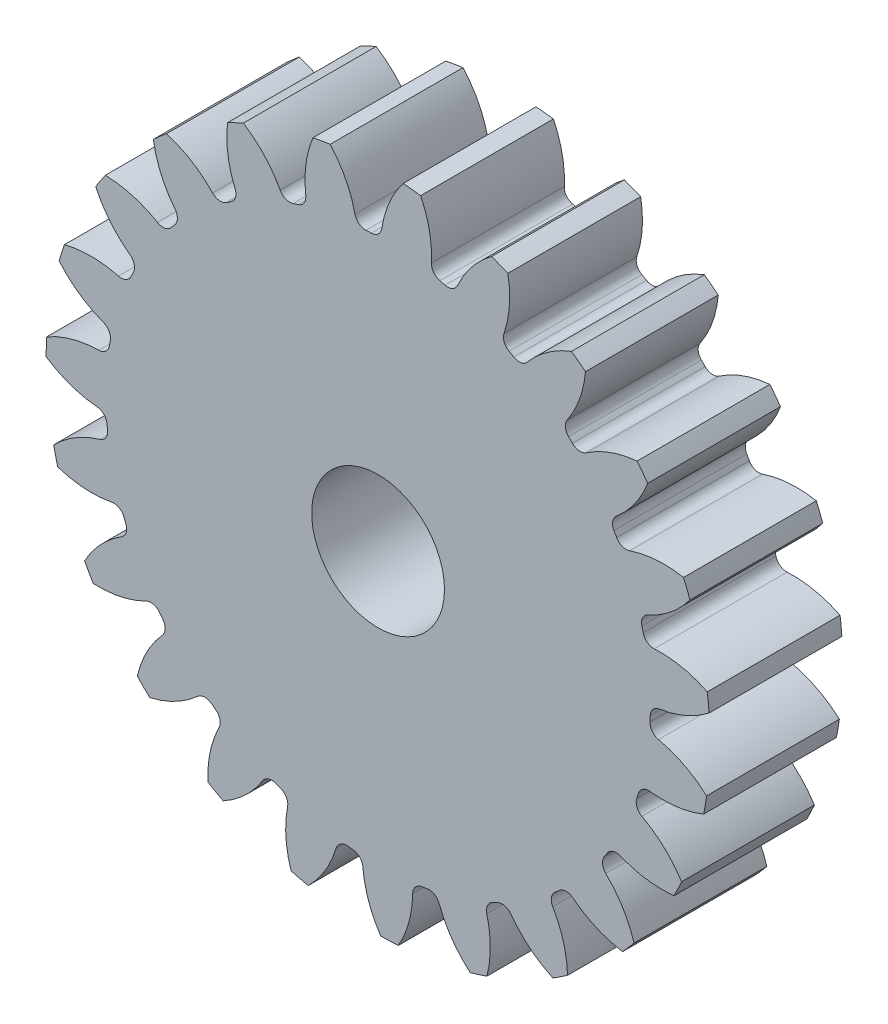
from build123d import *

# Parameters (mm, degrees)
SKETCH3_R         = 254
GEARBODY_DEPTH    = 101.6
TOOTHCUT_DEPTH    = 374.3022368
CIRPATTERN1_COUNT = 23
BOREDIA_R         = 50.8
BORE_DEPTH        = 12700


with BuildPart() as part:
    # Sketch3 → gearBody (new body)
    with BuildSketch(Plane.XY):
        Circle(SKETCH3_R)
    extrude(amount=GEARBODY_DEPTH)

    # Sketch2 → toothCut (cut, through all)
    with BuildSketch(Plane.XY):
        with BuildLine():
            ThreePointArc((208.081518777, -9.090651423), (208.16129706, -7.030846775), (208.22068578, -4.970353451))
            ThreePointArc((208.22068578, -4.970353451), (210.279643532, 0.295445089), (215.240585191, 3.00782396))
            ThreePointArc((215.240585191, 3.00782396), (235.733658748, 8.945202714), (254, 19.970596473))
            ThreePointArc((254, 19.970596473), (254.63867203, -8.600664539), (252.073611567, -37.063716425))
            ThreePointArc((252.073611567, -37.063716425), (234.592837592, -24.830929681), (214.547092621, -17.524313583))
            ThreePointArc((214.547092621, -17.524313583), (209.780474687, -14.483377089), (208.081518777, -9.090651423))
        make_face()
    toothcut = extrude(amount=TOOTHCUT_DEPTH, mode=Mode.SUBTRACT)

    # CirPattern1: toothCut ×23 about axis
    cirpattern1_axis = Axis((0, 0, 0), (0, 0, 1))
    for i in range(1, CIRPATTERN1_COUNT):
        add(toothcut.rotate(cirpattern1_axis, i * 360 / CIRPATTERN1_COUNT), mode=Mode.SUBTRACT)

    # boreDia → bore (cut, symmetric)
    with BuildSketch(Plane.XY):
        Circle(BOREDIA_R)
    extrude(amount=BORE_DEPTH, both=True, mode=Mode.SUBTRACT)


solid = part.part
